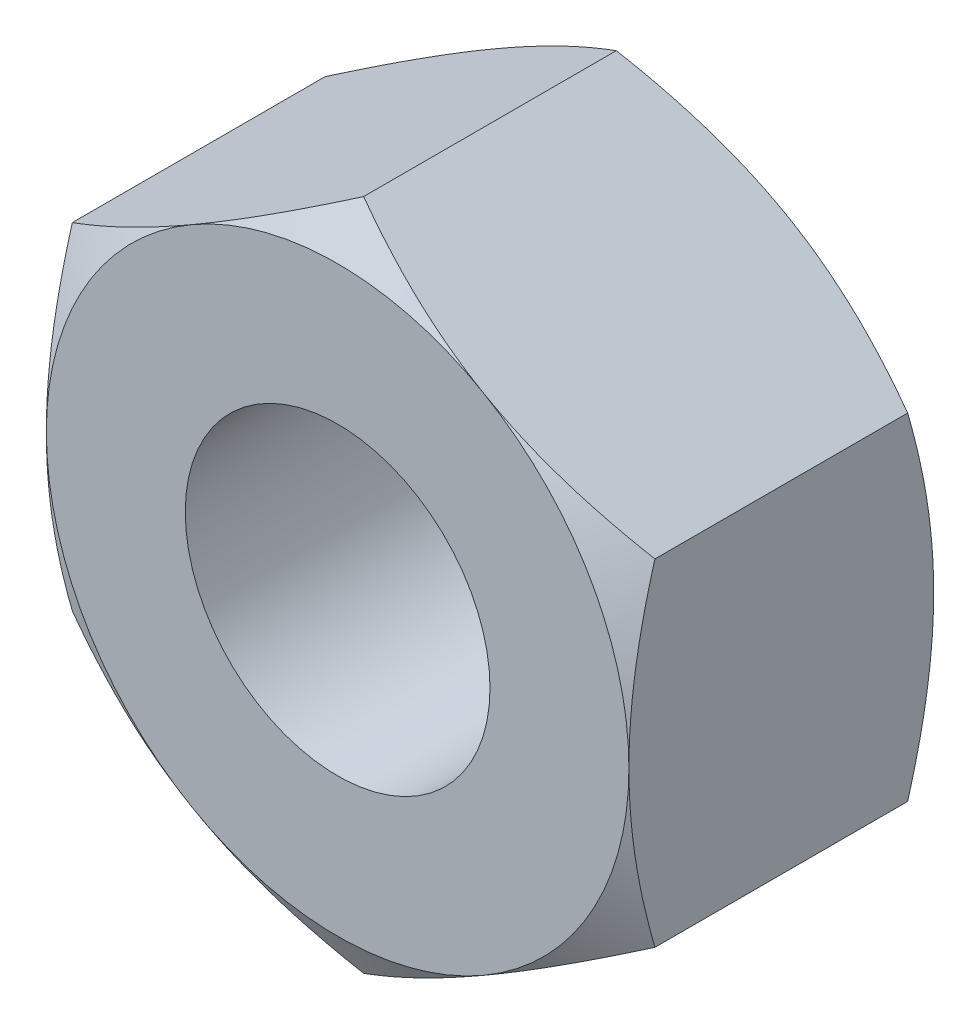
from build123d import *

# Parameters (mm, degrees)
EXTRUDE_1_DEPTH    = 3.4
HOLE_WIZARD_M8_1_D = 6.8


with BuildPart() as part:
    # Sketch 1 → Extrude 1 (new, symmetric)
    with BuildSketch(Plane.XY):
        Polygon((0, 7.505553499), (-6.5, 3.75277675), (-6.5, -3.75277675), (0, -7.505553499), (6.5, -3.75277675), (6.5, 3.75277675), align=None)
    extrude(amount=EXTRUDE_1_DEPTH, both=True)

    # Hole Wizard M8 _1 (through all)
    with Locations(Plane(origin=(0, 0, -3.4), x_dir=(-1, 0, 0), z_dir=(0, 0, -1))):
        with Locations((0, 0)):
            Hole(HOLE_WIZARD_M8_1_D / 2)

    # Sketch 4 → Cut-Revolve 1 (revolve, cut)
    with BuildSketch(Plane(origin=(0, 0, 0), x_dir=(1, 0, 0), z_dir=(0, 1, 0))):
        Polygon((-6.5, -3.4), (-10.306099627, -3.4), (-10.306099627, -1.202547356), align=None)
    cut_revolve_1 = revolve(axis=Axis((0, 0, 0), (0, 0, 1)), mode=Mode.SUBTRACT)

    # Mirror 1: Cut-Revolve 1 across plane
    add(cut_revolve_1.mirror(Plane.XY), mode=Mode.SUBTRACT)


solid = part.part
